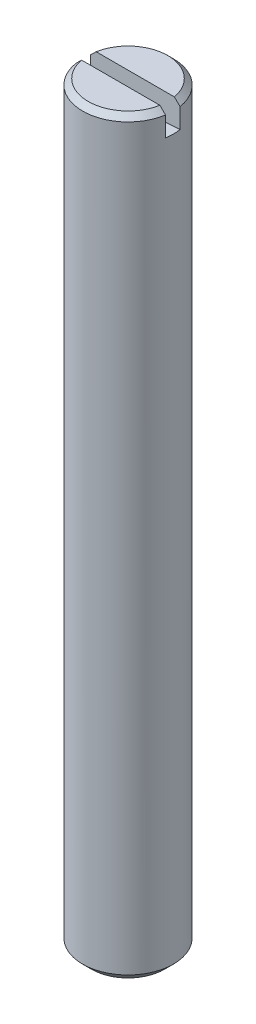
ISO-10303-21;
HEADER;
FILE_DESCRIPTION(('STEP AP214'),'2;1');
FILE_NAME('part.step','',(''),(''),'','','');
FILE_SCHEMA(('AUTOMOTIVE_DESIGN { 1 0 10303 214 1 1 1 1 }'));
ENDSEC;
DATA;
#1=APPLICATION_CONTEXT('core data for automotive mechanical design processes');
#2=APPLICATION_PROTOCOL_DEFINITION('international standard','automotive_design',2000,#1);
#3=PRODUCT_CONTEXT('',#1,'mechanical');
#4=PRODUCT('Part','Part','',(#3));
#5=PRODUCT_RELATED_PRODUCT_CATEGORY('part','',(#4));
#6=PRODUCT_DEFINITION_FORMATION('','',#4);
#7=PRODUCT_DEFINITION_CONTEXT('part definition',#1,'design');
#8=PRODUCT_DEFINITION('design','',#6,#7);
#9=PRODUCT_DEFINITION_SHAPE('','',#8);
#10=(LENGTH_UNIT() NAMED_UNIT(*) SI_UNIT(.MILLI.,.METRE.));
#11=(NAMED_UNIT(*) PLANE_ANGLE_UNIT() SI_UNIT($,.RADIAN.));
#12=(NAMED_UNIT(*) SI_UNIT($,.STERADIAN.) SOLID_ANGLE_UNIT());
#13=UNCERTAINTY_MEASURE_WITH_UNIT(LENGTH_MEASURE(1.E-05),#10,'distance_accuracy_value','');
#14=(GEOMETRIC_REPRESENTATION_CONTEXT(3) GLOBAL_UNCERTAINTY_ASSIGNED_CONTEXT((#13)) GLOBAL_UNIT_ASSIGNED_CONTEXT((#10,
#11,#12)) REPRESENTATION_CONTEXT('',''));
#15=CARTESIAN_POINT('',(0.,0.,0.));
#16=DIRECTION('',(0.,0.,1.));
#17=DIRECTION('',(1.,0.,0.));
#18=AXIS2_PLACEMENT_3D('',#15,#16,#17);
#19=CARTESIAN_POINT('',(0.,71.5,0.4));
#20=DIRECTION('',(0.,0.,-1.));
#21=DIRECTION('',(-1.,0.,0.));
#22=AXIS2_PLACEMENT_3D('',#19,#20,#21);
#23=CYLINDRICAL_SURFACE('',#22,31.5);
#24=CARTESIAN_POINT('',(2.46779253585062,40.096815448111,-0.4));
#25=CARTESIAN_POINT('',(2.47854531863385,40.0976618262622,-0.333698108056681));
#26=CARTESIAN_POINT('',(2.48661458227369,40.098300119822,-0.266959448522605));
#27=CARTESIAN_POINT('',(2.49732458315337,40.0991493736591,-0.133478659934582));
#28=CARTESIAN_POINT('',(2.5,40.0993630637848,-0.066739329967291));
#29=CARTESIAN_POINT('',(2.5,40.0993630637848,0.066739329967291));
#30=CARTESIAN_POINT('',(2.49732458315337,40.0991493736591,0.133478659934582));
#31=CARTESIAN_POINT('',(2.48661458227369,40.098300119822,0.266959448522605));
#32=CARTESIAN_POINT('',(2.47854531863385,40.0976618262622,0.333698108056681));
#33=CARTESIAN_POINT('',(2.46779253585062,40.096815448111,0.4));
#34=B_SPLINE_CURVE_WITH_KNOTS('',3,(#24,#25,#26,#27,#28,#29,#30,#31,#32,#33),.UNSPECIFIED.,.F.,
.F.,(4,2,2,2,4),(0.,0.201464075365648,0.401628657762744,0.601793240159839,0.803257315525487),.UNSPECIFIED.);
#35=CARTESIAN_POINT('',(2.46779253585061,40.096815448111,-0.4));
#36=VERTEX_POINT('',#35);
#37=CARTESIAN_POINT('',(2.46779253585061,40.096815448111,0.4));
#38=VERTEX_POINT('',#37);
#39=EDGE_CURVE('E81',#36,#38,#34,.T.);
#40=ORIENTED_EDGE('',*,*,#39,.F.);
#41=CARTESIAN_POINT('',(0.,71.5,-0.4));
#42=DIRECTION('',(0.,0.,-1.));
#43=DIRECTION('',(-1.,0.,0.));
#44=AXIS2_PLACEMENT_3D('',#41,#42,#43);
#45=CIRCLE('',#44,31.5);
#46=CARTESIAN_POINT('',(-2.46779253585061,40.096815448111,-0.4));
#47=VERTEX_POINT('',#46);
#48=EDGE_CURVE('E87',#47,#36,#45,.F.);
#49=ORIENTED_EDGE('',*,*,#48,.F.);
#50=CARTESIAN_POINT('',(-2.46779253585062,40.096815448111,0.4));
#51=CARTESIAN_POINT('',(-2.47854531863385,40.0976618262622,0.333698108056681));
#52=CARTESIAN_POINT('',(-2.48661458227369,40.098300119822,0.266959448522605));
#53=CARTESIAN_POINT('',(-2.49732458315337,40.0991493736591,0.133478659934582));
#54=CARTESIAN_POINT('',(-2.5,40.0993630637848,0.066739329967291));
#55=CARTESIAN_POINT('',(-2.5,40.0993630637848,-0.066739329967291));
#56=CARTESIAN_POINT('',(-2.49732458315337,40.0991493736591,-0.133478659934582));
#57=CARTESIAN_POINT('',(-2.48661458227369,40.098300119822,-0.266959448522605));
#58=CARTESIAN_POINT('',(-2.47854531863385,40.0976618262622,-0.333698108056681));
#59=CARTESIAN_POINT('',(-2.46779253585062,40.096815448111,-0.4));
#60=B_SPLINE_CURVE_WITH_KNOTS('',3,(#50,#51,#52,#53,#54,#55,#56,#57,#58,#59),.UNSPECIFIED.,.F.,
.F.,(4,2,2,2,4),(0.,0.201464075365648,0.401628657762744,0.601793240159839,0.803257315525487),.UNSPECIFIED.);
#61=CARTESIAN_POINT('',(-2.46779253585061,40.096815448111,0.4));
#62=VERTEX_POINT('',#61);
#63=EDGE_CURVE('E18',#62,#47,#60,.T.);
#64=ORIENTED_EDGE('',*,*,#63,.F.);
#65=CARTESIAN_POINT('',(0.,71.5,0.4));
#66=DIRECTION('',(0.,0.,-1.));
#67=DIRECTION('',(-1.,0.,0.));
#68=AXIS2_PLACEMENT_3D('',#65,#66,#67);
#69=CIRCLE('',#68,31.5);
#70=EDGE_CURVE('E80',#62,#38,#69,.F.);
#71=ORIENTED_EDGE('',*,*,#70,.T.);
#72=EDGE_LOOP('',(#40,#49,#64,#71));
#73=FACE_BOUND('',#72,.T.);
#74=ADVANCED_FACE('F14',(#73),#23,.F.);
#75=CARTESIAN_POINT('',(0.,71.5,0.4));
#76=DIRECTION('',(0.,0.,1.));
#77=DIRECTION('',(1.,0.,0.));
#78=AXIS2_PLACEMENT_3D('',#75,#76,#77);
#79=PLANE('',#78);
#80=DIRECTION('',(1.,0.,0.));
#81=VECTOR('',#80,1.);
#82=CARTESIAN_POINT('',(0.,41.5,0.4));
#83=LINE('',#82,#81);
#84=CARTESIAN_POINT('',(-2.1567202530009,41.4999999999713,0.4));
#85=VERTEX_POINT('',#84);
#86=CARTESIAN_POINT('',(2.1567202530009,41.4999999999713,0.4));
#87=VERTEX_POINT('',#86);
#88=EDGE_CURVE('E156',#85,#87,#83,.T.);
#89=ORIENTED_EDGE('',*,*,#88,.T.);
#90=CARTESIAN_POINT('',(2.46779253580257,41.1934999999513,0.4));
#91=CARTESIAN_POINT('',(2.41599728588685,41.2446342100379,0.4));
#92=CARTESIAN_POINT('',(2.36417697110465,41.2957429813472,0.4));
#93=CARTESIAN_POINT('',(2.26048621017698,41.3979096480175,0.4));
#94=CARTESIAN_POINT('',(2.20861576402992,41.448967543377,0.4));
#95=CARTESIAN_POINT('',(2.15672025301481,41.4999999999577,0.4));
#96=B_SPLINE_CURVE_WITH_KNOTS('',3,(#90,#91,#92,#93,#94,#95),.UNSPECIFIED.,.F.,.F.,(4,2,4),(0.,
0.21835078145,0.436701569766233),.UNSPECIFIED.);
#97=CARTESIAN_POINT('',(2.46779253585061,41.1934999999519,0.4));
#98=VERTEX_POINT('',#97);
#99=EDGE_CURVE('E94',#98,#87,#96,.T.);
#100=ORIENTED_EDGE('',*,*,#99,.F.);
#101=DIRECTION('',(0.,1.,0.));
#102=VECTOR('',#101,1.);
#103=CARTESIAN_POINT('',(2.46779253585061,71.5,0.4));
#104=LINE('',#103,#102);
#105=EDGE_CURVE('E92',#38,#98,#104,.T.);
#106=ORIENTED_EDGE('',*,*,#105,.F.);
#107=ORIENTED_EDGE('',*,*,#70,.F.);
#108=DIRECTION('',(0.,1.,0.));
#109=VECTOR('',#108,1.);
#110=CARTESIAN_POINT('',(-2.46779253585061,71.5,0.4));
#111=LINE('',#110,#109);
#112=CARTESIAN_POINT('',(-2.46779253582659,41.1934999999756,0.4));
#113=VERTEX_POINT('',#112);
#114=EDGE_CURVE('E72',#113,#62,#111,.F.);
#115=ORIENTED_EDGE('',*,*,#114,.F.);
#116=CARTESIAN_POINT('',(-2.15672025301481,41.4999999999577,0.4));
#117=CARTESIAN_POINT('',(-2.20861576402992,41.448967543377,0.4));
#118=CARTESIAN_POINT('',(-2.26048621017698,41.3979096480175,0.4));
#119=CARTESIAN_POINT('',(-2.36417697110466,41.2957429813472,0.4));
#120=CARTESIAN_POINT('',(-2.41599728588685,41.2446342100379,0.4));
#121=CARTESIAN_POINT('',(-2.46779253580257,41.1934999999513,0.4));
#122=B_SPLINE_CURVE_WITH_KNOTS('',3,(#116,#117,#118,#119,#120,#121),.UNSPECIFIED.,.F.,.F.,(4,2,
4),(0.,0.218350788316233,0.436701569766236),.UNSPECIFIED.);
#123=EDGE_CURVE('E144',#85,#113,#122,.T.);
#124=ORIENTED_EDGE('',*,*,#123,.F.);
#125=EDGE_LOOP('',(#89,#100,#106,#107,#115,#124));
#126=FACE_BOUND('',#125,.T.);
#127=ADVANCED_FACE('F90',(#126),#79,.F.);
#128=CARTESIAN_POINT('',(0.,71.5,-0.4));
#129=DIRECTION('',(0.,0.,1.));
#130=DIRECTION('',(1.,0.,0.));
#131=AXIS2_PLACEMENT_3D('',#128,#129,#130);
#132=PLANE('',#131);
#133=DIRECTION('',(1.,0.,0.));
#134=VECTOR('',#133,1.);
#135=CARTESIAN_POINT('',(0.,41.5,-0.4));
#136=LINE('',#135,#134);
#137=CARTESIAN_POINT('',(2.1567202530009,41.4999999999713,-0.4));
#138=VERTEX_POINT('',#137);
#139=CARTESIAN_POINT('',(-2.1567202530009,41.4999999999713,-0.4));
#140=VERTEX_POINT('',#139);
#141=EDGE_CURVE('E158',#138,#140,#136,.F.);
#142=ORIENTED_EDGE('',*,*,#141,.T.);
#143=CARTESIAN_POINT('',(-2.15672025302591,41.4999999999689,-0.400000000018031));
#144=CARTESIAN_POINT('',(-2.20861576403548,41.4489675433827,-0.400000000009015));
#145=CARTESIAN_POINT('',(-2.26048621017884,41.3979096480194,-0.400000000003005));
#146=CARTESIAN_POINT('',(-2.36417697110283,41.2957429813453,-0.399999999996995));
#147=CARTESIAN_POINT('',(-2.41599728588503,41.244634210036,-0.399999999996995));
#148=CARTESIAN_POINT('',(-2.4677925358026,41.1934999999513,-0.4));
#149=B_SPLINE_CURVE_WITH_KNOTS('',3,(#143,#144,#145,#146,#147,#148),.UNSPECIFIED.,.F.,.F.,(4,2,
4),(0.,0.218350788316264,0.436701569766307),.UNSPECIFIED.);
#150=CARTESIAN_POINT('',(-2.46779253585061,41.1934999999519,-0.4));
#151=VERTEX_POINT('',#150);
#152=EDGE_CURVE('E38',#140,#151,#149,.T.);
#153=ORIENTED_EDGE('',*,*,#152,.T.);
#154=DIRECTION('',(0.,1.,0.));
#155=VECTOR('',#154,1.);
#156=CARTESIAN_POINT('',(-2.46779253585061,71.5,-0.4));
#157=LINE('',#156,#155);
#158=EDGE_CURVE('E149',#151,#47,#157,.F.);
#159=ORIENTED_EDGE('',*,*,#158,.T.);
#160=ORIENTED_EDGE('',*,*,#48,.T.);
#161=DIRECTION('',(0.,1.,0.));
#162=VECTOR('',#161,1.);
#163=CARTESIAN_POINT('',(2.46779253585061,71.5,-0.4));
#164=LINE('',#163,#162);
#165=CARTESIAN_POINT('',(2.46779253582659,41.1934999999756,-0.4));
#166=VERTEX_POINT('',#165);
#167=EDGE_CURVE('E132',#36,#166,#164,.T.);
#168=ORIENTED_EDGE('',*,*,#167,.T.);
#169=CARTESIAN_POINT('',(2.46779253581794,41.1934999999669,-0.400000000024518));
#170=CARTESIAN_POINT('',(2.41599728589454,41.2446342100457,-0.400000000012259));
#171=CARTESIAN_POINT('',(2.36417697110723,41.2957429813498,-0.400000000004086));
#172=CARTESIAN_POINT('',(2.26048621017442,41.3979096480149,-0.399999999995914));
#173=CARTESIAN_POINT('',(2.20861576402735,41.4489675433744,-0.399999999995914));
#174=CARTESIAN_POINT('',(2.15672025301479,41.4999999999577,-0.4));
#175=B_SPLINE_CURVE_WITH_KNOTS('',3,(#169,#170,#171,#172,#173,#174),.UNSPECIFIED.,.F.,.F.,(4,2,
4),(0.,0.218350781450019,0.436701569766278),.UNSPECIFIED.);
#176=EDGE_CURVE('E126',#166,#138,#175,.T.);
#177=ORIENTED_EDGE('',*,*,#176,.T.);
#178=EDGE_LOOP('',(#142,#153,#159,#160,#168,#177));
#179=FACE_BOUND('',#178,.T.);
#180=ADVANCED_FACE('F133',(#179),#132,.T.);
#181=CARTESIAN_POINT('',(2.0095,0.,0.));
#182=DIRECTION('',(0.,1.,0.));
#183=DIRECTION('',(0.,0.,1.));
#184=AXIS2_PLACEMENT_3D('',#181,#182,#183);
#185=PLANE('',#184);
#186=CARTESIAN_POINT('',(0.,-5.6843418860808E-11,0.));
#187=DIRECTION('',(0.,1.,0.));
#188=DIRECTION('',(0.,0.,1.));
#189=AXIS2_PLACEMENT_3D('',#186,#187,#188);
#190=CIRCLE('',#189,2.00949999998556);
#191=CARTESIAN_POINT('',(0.,-5.6843418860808E-11,2.00949999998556));
#192=VERTEX_POINT('',#191);
#193=EDGE_CURVE('E162',#192,#192,#190,.T.);
#194=ORIENTED_EDGE('',*,*,#193,.F.);
#195=EDGE_LOOP('',(#194));
#196=FACE_BOUND('',#195,.T.);
#197=ADVANCED_FACE('F137',(#196),#185,.F.);
#198=CARTESIAN_POINT('',(0.,41.5,0.));
#199=DIRECTION('',(0.,-1.,0.));
#200=DIRECTION('',(0.,0.,-1.));
#201=AXIS2_PLACEMENT_3D('',#198,#199,#200);
#202=PLANE('',#201);
#203=ORIENTED_EDGE('',*,*,#88,.F.);
#204=CARTESIAN_POINT('',(0.,41.499999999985,0.));
#205=DIRECTION('',(0.,-1.,0.));
#206=DIRECTION('',(0.,0.,-1.));
#207=AXIS2_PLACEMENT_3D('',#204,#205,#206);
#208=CIRCLE('',#207,2.19349999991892);
#209=EDGE_CURVE('E154',#87,#85,#208,.T.);
#210=ORIENTED_EDGE('',*,*,#209,.F.);
#211=EDGE_LOOP('',(#203,#210));
#212=FACE_BOUND('',#211,.T.);
#213=ADVANCED_FACE('F160',(#212),#202,.F.);
#214=CARTESIAN_POINT('',(0.,41.5,0.));
#215=DIRECTION('',(0.,-1.,0.));
#216=DIRECTION('',(0.,0.,-1.));
#217=AXIS2_PLACEMENT_3D('',#214,#215,#216);
#218=PLANE('',#217);
#219=CARTESIAN_POINT('',(0.,41.499999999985,0.));
#220=DIRECTION('',(0.,-1.,0.));
#221=DIRECTION('',(0.,0.,-1.));
#222=AXIS2_PLACEMENT_3D('',#219,#220,#221);
#223=CIRCLE('',#222,2.19349999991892);
#224=EDGE_CURVE('E161',#140,#138,#223,.T.);
#225=ORIENTED_EDGE('',*,*,#224,.F.);
#226=ORIENTED_EDGE('',*,*,#141,.F.);
#227=EDGE_LOOP('',(#225,#226));
#228=FACE_BOUND('',#227,.T.);
#229=ADVANCED_FACE('F182',(#228),#218,.F.);
#230=CARTESIAN_POINT('',(0.,0.490500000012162,0.));
#231=DIRECTION('',(0.,1.,0.));
#232=DIRECTION('',(0.,0.,1.));
#233=AXIS2_PLACEMENT_3D('',#230,#231,#232);
#234=CONICAL_SURFACE('',#233,2.50000000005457,0.785398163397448);
#235=CARTESIAN_POINT('',(0.,0.4905,0.));
#236=DIRECTION('',(0.,-1.,0.));
#237=DIRECTION('',(0.,0.,-1.));
#238=AXIS2_PLACEMENT_3D('',#235,#236,#237);
#239=CIRCLE('',#238,2.5);
#240=CARTESIAN_POINT('',(0.,0.4905,-2.5));
#241=VERTEX_POINT('',#240);
#242=EDGE_CURVE('E164',#241,#241,#239,.F.);
#243=ORIENTED_EDGE('',*,*,#242,.F.);
#244=EDGE_LOOP('',(#243));
#245=FACE_BOUND('',#244,.T.);
#246=ORIENTED_EDGE('',*,*,#193,.T.);
#247=EDGE_LOOP('',(#246));
#248=FACE_BOUND('',#247,.T.);
#249=ADVANCED_FACE('F179',(#245,#248),#234,.T.);
#250=CARTESIAN_POINT('',(0.,41.1934999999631,0.));
#251=DIRECTION('',(0.,-1.,0.));
#252=DIRECTION('',(0.,0.,-1.));
#253=AXIS2_PLACEMENT_3D('',#250,#251,#252);
#254=CONICAL_SURFACE('',#253,2.49999999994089,0.785398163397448);
#255=ORIENTED_EDGE('',*,*,#209,.T.);
#256=ORIENTED_EDGE('',*,*,#123,.T.);
#257=CARTESIAN_POINT('',(0.,41.1935,0.));
#258=DIRECTION('',(0.,-1.,0.));
#259=DIRECTION('',(0.,0.,-1.));
#260=AXIS2_PLACEMENT_3D('',#257,#258,#259);
#261=CIRCLE('',#260,2.5);
#262=EDGE_CURVE('E29',#98,#113,#261,.T.);
#263=ORIENTED_EDGE('',*,*,#262,.F.);
#264=ORIENTED_EDGE('',*,*,#99,.T.);
#265=EDGE_LOOP('',(#255,#256,#263,#264));
#266=FACE_BOUND('',#265,.T.);
#267=ADVANCED_FACE('F114',(#266),#254,.T.);
#268=CARTESIAN_POINT('',(0.,41.1934999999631,0.));
#269=DIRECTION('',(0.,-1.,0.));
#270=DIRECTION('',(0.,0.,-1.));
#271=AXIS2_PLACEMENT_3D('',#268,#269,#270);
#272=CONICAL_SURFACE('',#271,2.49999999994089,0.785398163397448);
#273=ORIENTED_EDGE('',*,*,#152,.F.);
#274=ORIENTED_EDGE('',*,*,#224,.T.);
#275=ORIENTED_EDGE('',*,*,#176,.F.);
#276=CARTESIAN_POINT('',(0.,41.1935,0.));
#277=DIRECTION('',(0.,-1.,0.));
#278=DIRECTION('',(0.,0.,-1.));
#279=AXIS2_PLACEMENT_3D('',#276,#277,#278);
#280=CIRCLE('',#279,2.5);
#281=EDGE_CURVE('E9',#151,#166,#280,.T.);
#282=ORIENTED_EDGE('',*,*,#281,.F.);
#283=EDGE_LOOP('',(#273,#274,#275,#282));
#284=FACE_BOUND('',#283,.T.);
#285=ADVANCED_FACE('F110',(#284),#272,.T.);
#286=CARTESIAN_POINT('',(0.,30.,0.));
#287=DIRECTION('',(0.,-1.,0.));
#288=DIRECTION('',(0.,0.,-1.));
#289=AXIS2_PLACEMENT_3D('',#286,#287,#288);
#290=CYLINDRICAL_SURFACE('',#289,2.5);
#291=ORIENTED_EDGE('',*,*,#39,.T.);
#292=ORIENTED_EDGE('',*,*,#105,.T.);
#293=ORIENTED_EDGE('',*,*,#262,.T.);
#294=ORIENTED_EDGE('',*,*,#114,.T.);
#295=ORIENTED_EDGE('',*,*,#63,.T.);
#296=ORIENTED_EDGE('',*,*,#158,.F.);
#297=ORIENTED_EDGE('',*,*,#281,.T.);
#298=ORIENTED_EDGE('',*,*,#167,.F.);
#299=EDGE_LOOP('',(#291,#292,#293,#294,#295,#296,#297,#298));
#300=FACE_BOUND('',#299,.T.);
#301=ORIENTED_EDGE('',*,*,#242,.T.);
#302=EDGE_LOOP('',(#301));
#303=FACE_BOUND('',#302,.T.);
#304=ADVANCED_FACE('F74',(#300,#303),#290,.T.);
#305=CLOSED_SHELL('',(#74,#127,#180,#197,#213,#229,#249,#267,#285,#304));
#306=MANIFOLD_SOLID_BREP('B1',#305);
#307=ADVANCED_BREP_SHAPE_REPRESENTATION('',(#18,#306),#14);
#308=SHAPE_DEFINITION_REPRESENTATION(#9,#307);
ENDSEC;
END-ISO-10303-21;
